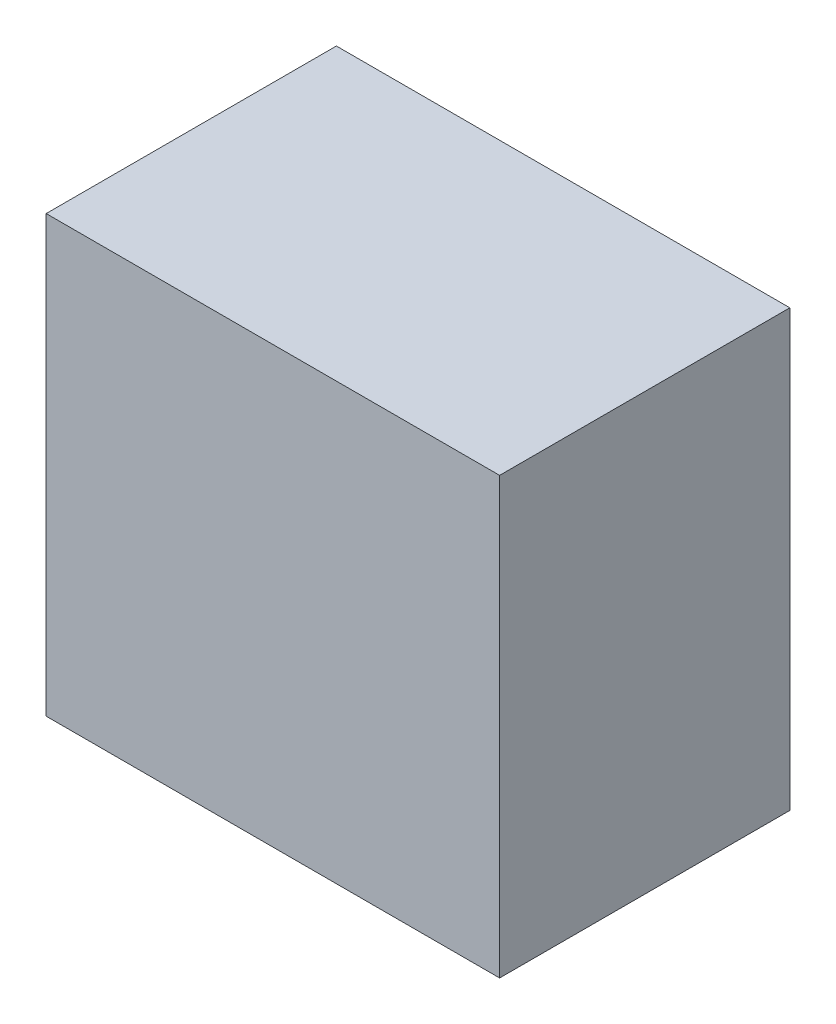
ISO-10303-21;
HEADER;
FILE_DESCRIPTION(('STEP AP214'),'2;1');
FILE_NAME('part.step','',(''),(''),'','','');
FILE_SCHEMA(('AUTOMOTIVE_DESIGN { 1 0 10303 214 1 1 1 1 }'));
ENDSEC;
DATA;
#1=APPLICATION_CONTEXT('core data for automotive mechanical design processes');
#2=APPLICATION_PROTOCOL_DEFINITION('international standard','automotive_design',2000,#1);
#3=PRODUCT_CONTEXT('',#1,'mechanical');
#4=PRODUCT('Part','Part','',(#3));
#5=PRODUCT_RELATED_PRODUCT_CATEGORY('part','',(#4));
#6=PRODUCT_DEFINITION_FORMATION('','',#4);
#7=PRODUCT_DEFINITION_CONTEXT('part definition',#1,'design');
#8=PRODUCT_DEFINITION('design','',#6,#7);
#9=PRODUCT_DEFINITION_SHAPE('','',#8);
#10=(LENGTH_UNIT() NAMED_UNIT(*) SI_UNIT(.MILLI.,.METRE.));
#11=(NAMED_UNIT(*) PLANE_ANGLE_UNIT() SI_UNIT($,.RADIAN.));
#12=(NAMED_UNIT(*) SI_UNIT($,.STERADIAN.) SOLID_ANGLE_UNIT());
#13=UNCERTAINTY_MEASURE_WITH_UNIT(LENGTH_MEASURE(1.E-05),#10,'distance_accuracy_value','');
#14=(GEOMETRIC_REPRESENTATION_CONTEXT(3) GLOBAL_UNCERTAINTY_ASSIGNED_CONTEXT((#13)) GLOBAL_UNIT_ASSIGNED_CONTEXT((#10,
#11,#12)) REPRESENTATION_CONTEXT('',''));
#15=CARTESIAN_POINT('',(0.,0.,0.));
#16=DIRECTION('',(0.,0.,1.));
#17=DIRECTION('',(1.,0.,0.));
#18=AXIS2_PLACEMENT_3D('',#15,#16,#17);
#19=CARTESIAN_POINT('',(0.,0.,16.));
#20=DIRECTION('',(0.,0.,1.));
#21=DIRECTION('',(1.,0.,0.));
#22=AXIS2_PLACEMENT_3D('',#19,#20,#21);
#23=PLANE('',#22);
#24=DIRECTION('',(-1.,0.,0.));
#25=VECTOR('',#24,1.);
#26=CARTESIAN_POINT('',(0.,-24.,16.));
#27=LINE('',#26,#25);
#28=CARTESIAN_POINT('',(25.,-24.,16.));
#29=VERTEX_POINT('',#28);
#30=CARTESIAN_POINT('',(-25.,-24.,16.));
#31=VERTEX_POINT('',#30);
#32=EDGE_CURVE('E11',#29,#31,#27,.T.);
#33=ORIENTED_EDGE('',*,*,#32,.F.);
#34=DIRECTION('',(0.,-1.,0.));
#35=VECTOR('',#34,1.);
#36=CARTESIAN_POINT('',(25.,0.,16.));
#37=LINE('',#36,#35);
#38=CARTESIAN_POINT('',(25.,24.,16.));
#39=VERTEX_POINT('',#38);
#40=EDGE_CURVE('E61',#39,#29,#37,.T.);
#41=ORIENTED_EDGE('',*,*,#40,.F.);
#42=DIRECTION('',(1.,0.,0.));
#43=VECTOR('',#42,1.);
#44=CARTESIAN_POINT('',(0.,24.,16.));
#45=LINE('',#44,#43);
#46=CARTESIAN_POINT('',(-25.,24.,16.));
#47=VERTEX_POINT('',#46);
#48=EDGE_CURVE('E87',#47,#39,#45,.T.);
#49=ORIENTED_EDGE('',*,*,#48,.F.);
#50=DIRECTION('',(0.,1.,0.));
#51=VECTOR('',#50,1.);
#52=CARTESIAN_POINT('',(-25.,0.,16.));
#53=LINE('',#52,#51);
#54=EDGE_CURVE('E24',#31,#47,#53,.T.);
#55=ORIENTED_EDGE('',*,*,#54,.F.);
#56=EDGE_LOOP('',(#33,#41,#49,#55));
#57=FACE_BOUND('',#56,.T.);
#58=ADVANCED_FACE('F17',(#57),#23,.T.);
#59=CARTESIAN_POINT('',(0.,-24.,-16.));
#60=DIRECTION('',(0.,-1.,0.));
#61=DIRECTION('',(0.,0.,-1.));
#62=AXIS2_PLACEMENT_3D('',#59,#60,#61);
#63=PLANE('',#62);
#64=DIRECTION('',(0.,0.,1.));
#65=VECTOR('',#64,1.);
#66=CARTESIAN_POINT('',(25.,-24.,-16.));
#67=LINE('',#66,#65);
#68=CARTESIAN_POINT('',(25.,-24.,-16.));
#69=VERTEX_POINT('',#68);
#70=EDGE_CURVE('E53',#69,#29,#67,.T.);
#71=ORIENTED_EDGE('',*,*,#70,.T.);
#72=ORIENTED_EDGE('',*,*,#32,.T.);
#73=DIRECTION('',(0.,0.,1.));
#74=VECTOR('',#73,1.);
#75=CARTESIAN_POINT('',(-25.,-24.,-16.));
#76=LINE('',#75,#74);
#77=CARTESIAN_POINT('',(-25.,-24.,-16.));
#78=VERTEX_POINT('',#77);
#79=EDGE_CURVE('E70',#78,#31,#76,.T.);
#80=ORIENTED_EDGE('',*,*,#79,.F.);
#81=DIRECTION('',(1.,0.,0.));
#82=VECTOR('',#81,1.);
#83=CARTESIAN_POINT('',(0.,-24.,-16.));
#84=LINE('',#83,#82);
#85=EDGE_CURVE('E65',#78,#69,#84,.T.);
#86=ORIENTED_EDGE('',*,*,#85,.T.);
#87=EDGE_LOOP('',(#71,#72,#80,#86));
#88=FACE_BOUND('',#87,.T.);
#89=ADVANCED_FACE('F66',(#88),#63,.T.);
#90=CARTESIAN_POINT('',(-25.,0.,-16.));
#91=DIRECTION('',(-1.,0.,0.));
#92=DIRECTION('',(0.,0.,1.));
#93=AXIS2_PLACEMENT_3D('',#90,#91,#92);
#94=PLANE('',#93);
#95=ORIENTED_EDGE('',*,*,#79,.T.);
#96=ORIENTED_EDGE('',*,*,#54,.T.);
#97=DIRECTION('',(0.,0.,1.));
#98=VECTOR('',#97,1.);
#99=CARTESIAN_POINT('',(-25.,24.,-16.));
#100=LINE('',#99,#98);
#101=CARTESIAN_POINT('',(-25.,24.,-16.));
#102=VERTEX_POINT('',#101);
#103=EDGE_CURVE('E85',#102,#47,#100,.T.);
#104=ORIENTED_EDGE('',*,*,#103,.F.);
#105=DIRECTION('',(0.,-1.,0.));
#106=VECTOR('',#105,1.);
#107=CARTESIAN_POINT('',(-25.,0.,-16.));
#108=LINE('',#107,#106);
#109=EDGE_CURVE('E75',#102,#78,#108,.T.);
#110=ORIENTED_EDGE('',*,*,#109,.T.);
#111=EDGE_LOOP('',(#95,#96,#104,#110));
#112=FACE_BOUND('',#111,.T.);
#113=ADVANCED_FACE('F93',(#112),#94,.T.);
#114=CARTESIAN_POINT('',(0.,24.,-16.));
#115=DIRECTION('',(0.,1.,0.));
#116=DIRECTION('',(0.,0.,1.));
#117=AXIS2_PLACEMENT_3D('',#114,#115,#116);
#118=PLANE('',#117);
#119=ORIENTED_EDGE('',*,*,#103,.T.);
#120=ORIENTED_EDGE('',*,*,#48,.T.);
#121=DIRECTION('',(0.,0.,1.));
#122=VECTOR('',#121,1.);
#123=CARTESIAN_POINT('',(25.,24.,-16.));
#124=LINE('',#123,#122);
#125=CARTESIAN_POINT('',(25.,24.,-16.));
#126=VERTEX_POINT('',#125);
#127=EDGE_CURVE('E62',#126,#39,#124,.T.);
#128=ORIENTED_EDGE('',*,*,#127,.F.);
#129=DIRECTION('',(-1.,0.,0.));
#130=VECTOR('',#129,1.);
#131=CARTESIAN_POINT('',(0.,24.,-16.));
#132=LINE('',#131,#130);
#133=EDGE_CURVE('E76',#126,#102,#132,.T.);
#134=ORIENTED_EDGE('',*,*,#133,.T.);
#135=EDGE_LOOP('',(#119,#120,#128,#134));
#136=FACE_BOUND('',#135,.T.);
#137=ADVANCED_FACE('F90',(#136),#118,.T.);
#138=CARTESIAN_POINT('',(0.,0.,-16.));
#139=DIRECTION('',(0.,0.,-1.));
#140=DIRECTION('',(-1.,0.,0.));
#141=AXIS2_PLACEMENT_3D('',#138,#139,#140);
#142=PLANE('',#141);
#143=DIRECTION('',(0.,1.,0.));
#144=VECTOR('',#143,1.);
#145=CARTESIAN_POINT('',(25.,0.,-16.));
#146=LINE('',#145,#144);
#147=EDGE_CURVE('E56',#69,#126,#146,.T.);
#148=ORIENTED_EDGE('',*,*,#147,.F.);
#149=ORIENTED_EDGE('',*,*,#85,.F.);
#150=ORIENTED_EDGE('',*,*,#109,.F.);
#151=ORIENTED_EDGE('',*,*,#133,.F.);
#152=EDGE_LOOP('',(#148,#149,#150,#151));
#153=FACE_BOUND('',#152,.T.);
#154=ADVANCED_FACE('F72',(#153),#142,.T.);
#155=CARTESIAN_POINT('',(25.,0.,-16.));
#156=DIRECTION('',(1.,0.,0.));
#157=DIRECTION('',(0.,0.,-1.));
#158=AXIS2_PLACEMENT_3D('',#155,#156,#157);
#159=PLANE('',#158);
#160=ORIENTED_EDGE('',*,*,#147,.T.);
#161=ORIENTED_EDGE('',*,*,#127,.T.);
#162=ORIENTED_EDGE('',*,*,#40,.T.);
#163=ORIENTED_EDGE('',*,*,#70,.F.);
#164=EDGE_LOOP('',(#160,#161,#162,#163));
#165=FACE_BOUND('',#164,.T.);
#166=ADVANCED_FACE('F57',(#165),#159,.T.);
#167=CLOSED_SHELL('',(#58,#89,#113,#137,#154,#166));
#168=MANIFOLD_SOLID_BREP('B1',#167);
#169=ADVANCED_BREP_SHAPE_REPRESENTATION('',(#18,#168),#14);
#170=SHAPE_DEFINITION_REPRESENTATION(#9,#169);
ENDSEC;
END-ISO-10303-21;
